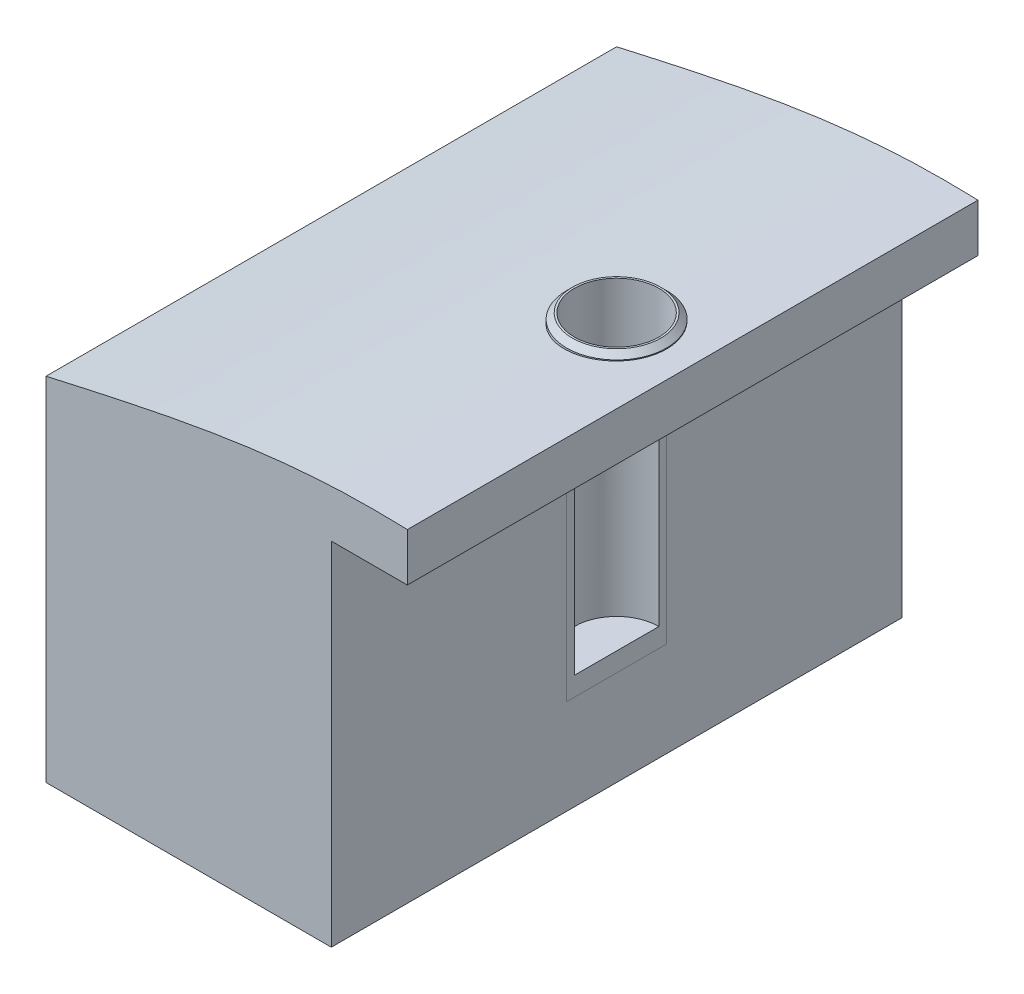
from build123d import *

# Parameters (mm, degrees)
EXTRUDE_BREDD_DEPTH                     = 300
SKETCH2_R                               = 52.45
CUT_BORRH_L_DEPTH                       = 320
CUT_BORRH_L_DIRECTION_2_REACH           = 598.883
EXTRUDE_INJEKTERINGSMEDEL_DEPTH         = 8
EXTRUDE_INJEKTERINGSMEDEL_DEPTH_BACK    = 320
SKETCH3_R                               = 52.45
SKETCH6_R                               = 44.45
CUT_H_L_F_R_F_RANKRINGSST_NG_DEPTH      = 308
CHAMFER_OVANSIDA_INJEKTERINGSMEDEL_SIZE = 6
CUT_SPR_NGSNITT_DEPTH                   = 597.883344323
CUT_SPR_NGSNITT_DEPTH_BACK              = 597.883344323


with BuildPart() as part:
    # Sketch1 → Extrude bredd (new, symmetric)
    with BuildSketch(Plane.XY):
        with BuildLine():
            Line((-300, -49.844883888), (-300, -419.844883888))
            Line((-300, -419.844883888), (300, -419.844883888))
            Line((300, -419.844883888), (300, -19.844883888))
            add(Edge.make_bspline(
                [(300, -19.844883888), (199.717435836, -7.502586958), (-2.000766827, 17.323921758), (-200.289099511, -27.370121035), (-300, -49.844883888)],
                knots=[0, 0, 0, 0, 0.497141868, 1, 1, 1, 1], degree=3))
        make_face()
    extrude(amount=EXTRUDE_BREDD_DEPTH, both=True)

    # Sketch2 → Cut borrh_l (cut)
    with BuildSketch(Plane(origin=(0, 0, 0), x_dir=(1, 0, 0), z_dir=(0, 1, 0))):
        with Locations(Location((0, 0, 0), (0, 0, 90))):
            Circle(SKETCH2_R)
    extrude(amount=-CUT_BORRH_L_DEPTH, mode=Mode.SUBTRACT)

    # Sketch2 → Cut borrh_l direction 2 (cut, up to next)
    with BuildSketch(Plane(origin=(0, 0, 0), x_dir=(1, 0, 0), z_dir=(0, 1, 0)), mode=Mode.PRIVATE) as cut_borrh_l_direction_2_sk1:
        with Locations(Location((0, 0, 0), (0, 0, 90))):
            Circle(SKETCH2_R)
    cut_borrh_l_direction_2_tool1 = extrude(cut_borrh_l_direction_2_sk1.sketch, amount=CUT_BORRH_L_DIRECTION_2_REACH, mode=Mode.PRIVATE) & part.part
    add(cut_borrh_l_direction_2_tool1.solids().sort_by_distance((0, 0, 0))[0], mode=Mode.SUBTRACT)


with BuildPart() as body_2:
    # Sketch3 → Extrude injekteringsmedel (new, two sides: drawn at the far end of the back side and taken through both)
    with BuildSketch(Plane(origin=(0, 0, 0), x_dir=(1, 0, 0), z_dir=(0, 1, 0)).offset(-EXTRUDE_INJEKTERINGSMEDEL_DEPTH_BACK)):
        with Locations(Location((0, 0, 0), (0, 0, 270))):
            Circle(SKETCH3_R)
    extrude(amount=EXTRUDE_INJEKTERINGSMEDEL_DEPTH + EXTRUDE_INJEKTERINGSMEDEL_DEPTH_BACK)

    # Sketch6 → Cut h_l f_r f_rankringsst_ng (cut)
    with BuildSketch(Plane(origin=(0, 8, 0), x_dir=(-1, 0, 0), z_dir=(0, 1, 0))):
        with Locations(Location((0, 0, 0), (0, 0, 90))):
            Circle(SKETCH6_R)
    extrude(amount=-CUT_H_L_F_R_F_RANKRINGSST_NG_DEPTH, mode=Mode.SUBTRACT)

    # Chamfer ovansida injekteringsmedel
    chamfer_ovansida_injekteringsmedel_edges = [body_2.edges().sort_by_distance(p)[0] for p in [
        (0, 8, -52.45),
    ]]
    chamfer(chamfer_ovansida_injekteringsmedel_edges, length=CHAMFER_OVANSIDA_INJEKTERINGSMEDEL_SIZE)


with BuildPart() as cut_spr_ngsnitt_tool:
    # Sketch5 → Cut spr_ngsnitt (new, two sides: drawn at the far end of the back side and taken through both)
    with BuildSketch(Plane.XY.offset(-CUT_SPR_NGSNITT_DEPTH_BACK)):
        Polygon((80, 1268.559829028), (80, 50), (80, -50), (0, -50), (0, -419.844883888), (0, -1638.404712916), (2436.197297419, -1705.449143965), (2516.197297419, 1201.51539798), align=None)
    extrude(amount=CUT_SPR_NGSNITT_DEPTH + CUT_SPR_NGSNITT_DEPTH_BACK)


with BuildPart() as part_1:
    add(part.part)

    # Cut spr_ngsnitt: cut by cut_spr_ngsnitt_tool
    add(cut_spr_ngsnitt_tool.part, mode=Mode.SUBTRACT)


with BuildPart() as body_2_1:
    add(body_2.part)

    # Cut spr_ngsnitt: cut by cut_spr_ngsnitt_tool
    add(cut_spr_ngsnitt_tool.part, mode=Mode.SUBTRACT)


solid = Compound([part_1.part, body_2_1.part])
